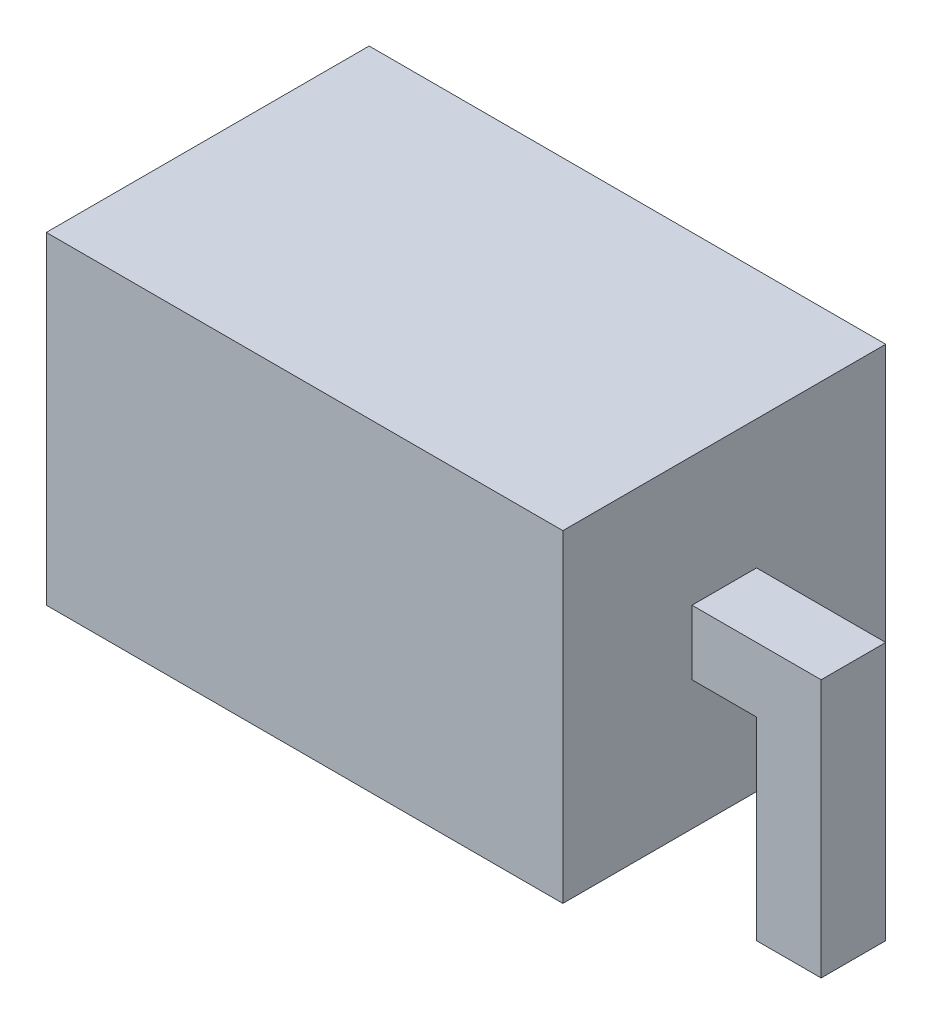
from build123d import *

# Parameters (mm, degrees)
SKETCH99_W               = 4
SKETCH99_H               = 2.5
BOSS_EXTRUDE5_DEPTH      = 2.5
BOSS_EXTRUDE6_DEPTH      = 0.25
BOSS_EXTRUDE6_DEPTH_BACK = 0.25


with BuildPart() as part:
    # Sketch99 → Boss-Extrude5 (new body)
    with BuildSketch(Plane.XY):
        Rectangle(SKETCH99_W, SKETCH99_H)
    extrude(amount=BOSS_EXTRUDE5_DEPTH)

    # Sketch100 → Boss-Extrude6 (add, two sides: drawn at the far end of the back side and taken through both)
    with BuildSketch(Plane.XY.offset(1.25).offset(-BOSS_EXTRUDE6_DEPTH_BACK)):
        Polygon((2, 0.25), (2, -0.25), (2.5, -0.25), (2.5, -1.75), (3, -1.75), (3, -0.25), (3, 0.25), align=None)
        Polygon((-2.5, -0.25), (-2.5, -1.75), (-3, -1.75), (-3, 0.25), (-2, 0.25), (-2, -0.25), align=None)
    extrude(amount=BOSS_EXTRUDE6_DEPTH + BOSS_EXTRUDE6_DEPTH_BACK)


solid = part.part
